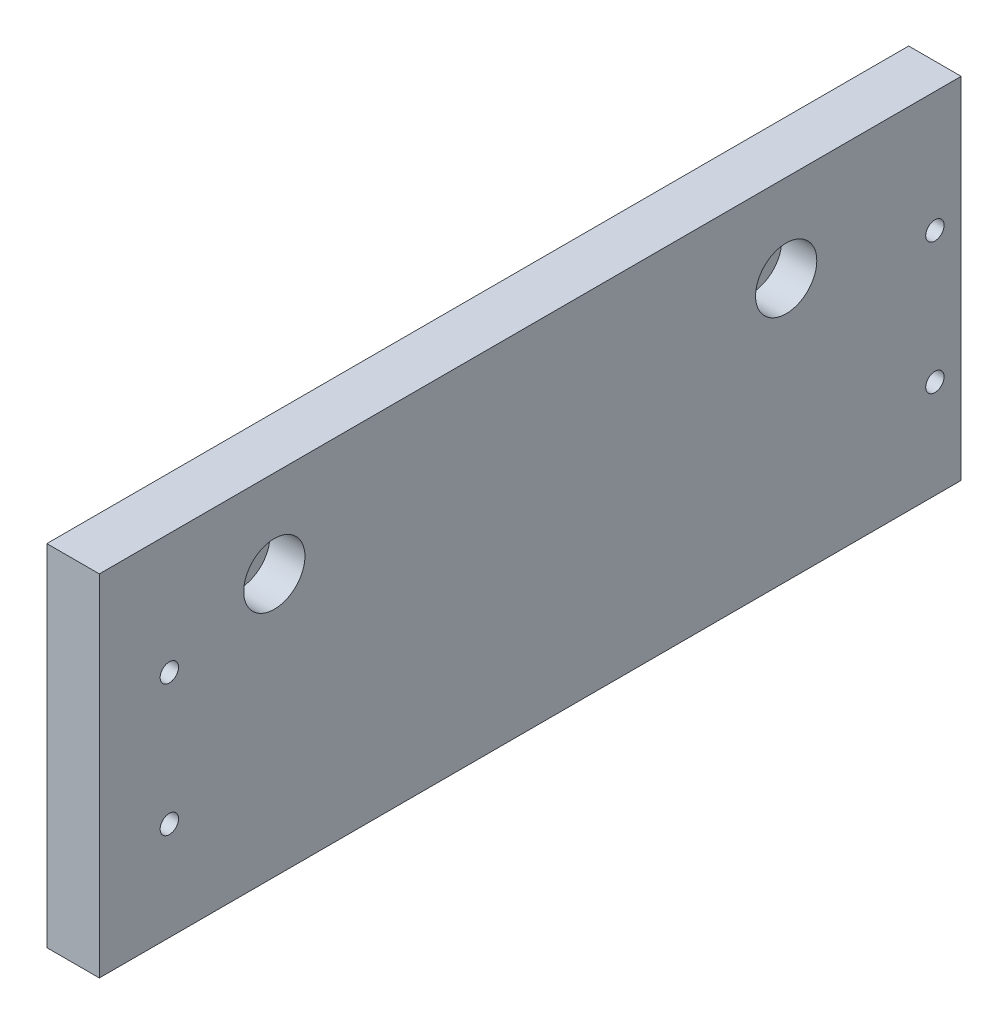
ISO-10303-21;
HEADER;
FILE_DESCRIPTION(('STEP AP214'),'2;1');
FILE_NAME('part.step','',(''),(''),'','','');
FILE_SCHEMA(('AUTOMOTIVE_DESIGN { 1 0 10303 214 1 1 1 1 }'));
ENDSEC;
DATA;
#1=APPLICATION_CONTEXT('core data for automotive mechanical design processes');
#2=APPLICATION_PROTOCOL_DEFINITION('international standard','automotive_design',2000,#1);
#3=PRODUCT_CONTEXT('',#1,'mechanical');
#4=PRODUCT('Part','Part','',(#3));
#5=PRODUCT_RELATED_PRODUCT_CATEGORY('part','',(#4));
#6=PRODUCT_DEFINITION_FORMATION('','',#4);
#7=PRODUCT_DEFINITION_CONTEXT('part definition',#1,'design');
#8=PRODUCT_DEFINITION('design','',#6,#7);
#9=PRODUCT_DEFINITION_SHAPE('','',#8);
#10=(LENGTH_UNIT() NAMED_UNIT(*) SI_UNIT(.MILLI.,.METRE.));
#11=(NAMED_UNIT(*) PLANE_ANGLE_UNIT() SI_UNIT($,.RADIAN.));
#12=(NAMED_UNIT(*) SI_UNIT($,.STERADIAN.) SOLID_ANGLE_UNIT());
#13=UNCERTAINTY_MEASURE_WITH_UNIT(LENGTH_MEASURE(1.E-05),#10,'distance_accuracy_value','');
#14=(GEOMETRIC_REPRESENTATION_CONTEXT(3) GLOBAL_UNCERTAINTY_ASSIGNED_CONTEXT((#13)) GLOBAL_UNIT_ASSIGNED_CONTEXT((#10,
#11,#12)) REPRESENTATION_CONTEXT('',''));
#15=CARTESIAN_POINT('',(0.,0.,0.));
#16=DIRECTION('',(0.,0.,1.));
#17=DIRECTION('',(1.,0.,0.));
#18=AXIS2_PLACEMENT_3D('',#15,#16,#17);
#19=CARTESIAN_POINT('',(4.,20.,-58.5));
#20=DIRECTION('',(1.,0.,0.));
#21=DIRECTION('',(0.,0.,-1.));
#22=AXIS2_PLACEMENT_3D('',#19,#20,#21);
#23=CYLINDRICAL_SURFACE('',#22,7.00000000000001);
#24=CARTESIAN_POINT('',(12.,20.,-58.5));
#25=DIRECTION('',(1.,0.,0.));
#26=DIRECTION('',(0.,0.,-1.));
#27=AXIS2_PLACEMENT_3D('',#24,#25,#26);
#28=CIRCLE('',#27,7.00000000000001);
#29=CARTESIAN_POINT('',(12.,20.,-65.5));
#30=VERTEX_POINT('',#29);
#31=EDGE_CURVE('E121',#30,#30,#28,.F.);
#32=ORIENTED_EDGE('',*,*,#31,.F.);
#33=EDGE_LOOP('',(#32));
#34=FACE_BOUND('',#33,.T.);
#35=CARTESIAN_POINT('',(4.,20.,-58.5));
#36=DIRECTION('',(1.,0.,0.));
#37=DIRECTION('',(0.,0.,-1.));
#38=AXIS2_PLACEMENT_3D('',#35,#36,#37);
#39=CIRCLE('',#38,7.00000000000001);
#40=CARTESIAN_POINT('',(4.,20.,-65.5));
#41=VERTEX_POINT('',#40);
#42=EDGE_CURVE('E20',#41,#41,#39,.T.);
#43=ORIENTED_EDGE('',*,*,#42,.F.);
#44=EDGE_LOOP('',(#43));
#45=FACE_BOUND('',#44,.T.);
#46=ADVANCED_FACE('F17',(#34,#45),#23,.F.);
#47=CARTESIAN_POINT('',(4.,20.,58.5));
#48=DIRECTION('',(1.,0.,0.));
#49=DIRECTION('',(0.,0.,-1.));
#50=AXIS2_PLACEMENT_3D('',#47,#48,#49);
#51=CYLINDRICAL_SURFACE('',#50,7.);
#52=CARTESIAN_POINT('',(12.,20.,58.5));
#53=DIRECTION('',(1.,0.,0.));
#54=DIRECTION('',(0.,0.,-1.));
#55=AXIS2_PLACEMENT_3D('',#52,#53,#54);
#56=CIRCLE('',#55,7.);
#57=CARTESIAN_POINT('',(12.,20.,51.5));
#58=VERTEX_POINT('',#57);
#59=EDGE_CURVE('E118',#58,#58,#56,.F.);
#60=ORIENTED_EDGE('',*,*,#59,.F.);
#61=EDGE_LOOP('',(#60));
#62=FACE_BOUND('',#61,.T.);
#63=CARTESIAN_POINT('',(4.,20.,58.5));
#64=DIRECTION('',(1.,0.,0.));
#65=DIRECTION('',(0.,0.,-1.));
#66=AXIS2_PLACEMENT_3D('',#63,#64,#65);
#67=CIRCLE('',#66,7.);
#68=CARTESIAN_POINT('',(4.,20.,51.5));
#69=VERTEX_POINT('',#68);
#70=EDGE_CURVE('E123',#69,#69,#67,.T.);
#71=ORIENTED_EDGE('',*,*,#70,.F.);
#72=EDGE_LOOP('',(#71));
#73=FACE_BOUND('',#72,.T.);
#74=ADVANCED_FACE('F133',(#62,#73),#51,.F.);
#75=CARTESIAN_POINT('',(4.,20.,-58.5));
#76=DIRECTION('',(1.,0.,0.));
#77=DIRECTION('',(0.,0.,-1.));
#78=AXIS2_PLACEMENT_3D('',#75,#76,#77);
#79=PLANE('',#78);
#80=CARTESIAN_POINT('',(4.,20.,-58.5));
#81=DIRECTION('',(1.,0.,0.));
#82=DIRECTION('',(0.,0.,-1.));
#83=AXIS2_PLACEMENT_3D('',#80,#81,#82);
#84=CIRCLE('',#83,4.25);
#85=CARTESIAN_POINT('',(4.,20.,-62.75));
#86=VERTEX_POINT('',#85);
#87=EDGE_CURVE('E115',#86,#86,#84,.F.);
#88=ORIENTED_EDGE('',*,*,#87,.T.);
#89=EDGE_LOOP('',(#88));
#90=FACE_BOUND('',#89,.T.);
#91=ORIENTED_EDGE('',*,*,#42,.T.);
#92=EDGE_LOOP('',(#91));
#93=FACE_BOUND('',#92,.T.);
#94=ADVANCED_FACE('F130',(#90,#93),#79,.T.);
#95=CARTESIAN_POINT('',(4.,20.,58.5));
#96=DIRECTION('',(1.,0.,0.));
#97=DIRECTION('',(0.,0.,-1.));
#98=AXIS2_PLACEMENT_3D('',#95,#96,#97);
#99=PLANE('',#98);
#100=CARTESIAN_POINT('',(4.,20.,58.5));
#101=DIRECTION('',(1.,0.,0.));
#102=DIRECTION('',(0.,0.,-1.));
#103=AXIS2_PLACEMENT_3D('',#100,#101,#102);
#104=CIRCLE('',#103,4.25);
#105=CARTESIAN_POINT('',(4.,20.,54.25));
#106=VERTEX_POINT('',#105);
#107=EDGE_CURVE('E112',#106,#106,#104,.F.);
#108=ORIENTED_EDGE('',*,*,#107,.T.);
#109=EDGE_LOOP('',(#108));
#110=FACE_BOUND('',#109,.T.);
#111=ORIENTED_EDGE('',*,*,#70,.T.);
#112=EDGE_LOOP('',(#111));
#113=FACE_BOUND('',#112,.T.);
#114=ADVANCED_FACE('F187',(#110,#113),#99,.T.);
#115=CARTESIAN_POINT('',(12.,0.,0.));
#116=DIRECTION('',(1.,0.,0.));
#117=DIRECTION('',(0.,0.,-1.));
#118=AXIS2_PLACEMENT_3D('',#115,#116,#117);
#119=PLANE('',#118);
#120=DIRECTION('',(0.,1.,0.));
#121=VECTOR('',#120,1.);
#122=CARTESIAN_POINT('',(12.,40.,98.5));
#123=LINE('',#122,#121);
#124=CARTESIAN_POINT('',(12.,40.,98.5));
#125=VERTEX_POINT('',#124);
#126=CARTESIAN_POINT('',(12.,-40.,98.5));
#127=VERTEX_POINT('',#126);
#128=EDGE_CURVE('E55',#125,#127,#123,.F.);
#129=ORIENTED_EDGE('',*,*,#128,.T.);
#130=DIRECTION('',(0.,0.,1.));
#131=VECTOR('',#130,1.);
#132=CARTESIAN_POINT('',(12.,-40.,98.5));
#133=LINE('',#132,#131);
#134=CARTESIAN_POINT('',(12.,-40.,-98.5));
#135=VERTEX_POINT('',#134);
#136=EDGE_CURVE('E358',#127,#135,#133,.F.);
#137=ORIENTED_EDGE('',*,*,#136,.T.);
#138=DIRECTION('',(0.,-1.,0.));
#139=VECTOR('',#138,1.);
#140=CARTESIAN_POINT('',(12.,40.,-98.5));
#141=LINE('',#140,#139);
#142=CARTESIAN_POINT('',(12.,40.,-98.5));
#143=VERTEX_POINT('',#142);
#144=EDGE_CURVE('E61',#135,#143,#141,.F.);
#145=ORIENTED_EDGE('',*,*,#144,.T.);
#146=DIRECTION('',(0.,0.,-1.));
#147=VECTOR('',#146,1.);
#148=CARTESIAN_POINT('',(12.,40.,98.5));
#149=LINE('',#148,#147);
#150=EDGE_CURVE('E58',#143,#125,#149,.F.);
#151=ORIENTED_EDGE('',*,*,#150,.T.);
#152=EDGE_LOOP('',(#129,#137,#145,#151));
#153=FACE_BOUND('',#152,.T.);
#154=CARTESIAN_POINT('',(12.,-17.5,-92.5));
#155=DIRECTION('',(1.,0.,0.));
#156=DIRECTION('',(0.,0.,-1.));
#157=AXIS2_PLACEMENT_3D('',#154,#155,#156);
#158=CIRCLE('',#157,2.09999999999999);
#159=CARTESIAN_POINT('',(12.,-17.5,-94.6));
#160=VERTEX_POINT('',#159);
#161=EDGE_CURVE('E67',#160,#160,#158,.F.);
#162=ORIENTED_EDGE('',*,*,#161,.T.);
#163=EDGE_LOOP('',(#162));
#164=FACE_BOUND('',#163,.T.);
#165=CARTESIAN_POINT('',(12.,12.5,-92.5));
#166=DIRECTION('',(1.,0.,0.));
#167=DIRECTION('',(0.,0.,-1.));
#168=AXIS2_PLACEMENT_3D('',#165,#166,#167);
#169=CIRCLE('',#168,2.09999999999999);
#170=CARTESIAN_POINT('',(12.,12.5,-94.6));
#171=VERTEX_POINT('',#170);
#172=EDGE_CURVE('E103',#171,#171,#169,.F.);
#173=ORIENTED_EDGE('',*,*,#172,.T.);
#174=EDGE_LOOP('',(#173));
#175=FACE_BOUND('',#174,.T.);
#176=CARTESIAN_POINT('',(12.,-17.5,82.5));
#177=DIRECTION('',(1.,0.,0.));
#178=DIRECTION('',(0.,0.,-1.));
#179=AXIS2_PLACEMENT_3D('',#176,#177,#178);
#180=CIRCLE('',#179,2.09999999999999);
#181=CARTESIAN_POINT('',(12.,-17.5,80.4));
#182=VERTEX_POINT('',#181);
#183=EDGE_CURVE('E106',#182,#182,#180,.F.);
#184=ORIENTED_EDGE('',*,*,#183,.T.);
#185=EDGE_LOOP('',(#184));
#186=FACE_BOUND('',#185,.T.);
#187=CARTESIAN_POINT('',(12.,12.5,82.5));
#188=DIRECTION('',(1.,0.,0.));
#189=DIRECTION('',(0.,0.,-1.));
#190=AXIS2_PLACEMENT_3D('',#187,#188,#189);
#191=CIRCLE('',#190,2.09999999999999);
#192=CARTESIAN_POINT('',(12.,12.5,80.4));
#193=VERTEX_POINT('',#192);
#194=EDGE_CURVE('E109',#193,#193,#191,.F.);
#195=ORIENTED_EDGE('',*,*,#194,.T.);
#196=EDGE_LOOP('',(#195));
#197=FACE_BOUND('',#196,.T.);
#198=ORIENTED_EDGE('',*,*,#59,.T.);
#199=EDGE_LOOP('',(#198));
#200=FACE_BOUND('',#199,.T.);
#201=ORIENTED_EDGE('',*,*,#31,.T.);
#202=EDGE_LOOP('',(#201));
#203=FACE_BOUND('',#202,.T.);
#204=ADVANCED_FACE('F59',(#153,#164,#175,#186,#197,#200,#203),#119,.T.);
#205=CARTESIAN_POINT('',(0.,20.,-58.5));
#206=DIRECTION('',(1.,0.,0.));
#207=DIRECTION('',(0.,0.,-1.));
#208=AXIS2_PLACEMENT_3D('',#205,#206,#207);
#209=CYLINDRICAL_SURFACE('',#208,4.25);
#210=CARTESIAN_POINT('',(0.,20.,-58.5));
#211=DIRECTION('',(1.,0.,0.));
#212=DIRECTION('',(0.,0.,-1.));
#213=AXIS2_PLACEMENT_3D('',#210,#211,#212);
#214=CIRCLE('',#213,4.25);
#215=CARTESIAN_POINT('',(0.,20.,-62.75));
#216=VERTEX_POINT('',#215);
#217=EDGE_CURVE('E97',#216,#216,#214,.F.);
#218=ORIENTED_EDGE('',*,*,#217,.T.);
#219=EDGE_LOOP('',(#218));
#220=FACE_BOUND('',#219,.T.);
#221=ORIENTED_EDGE('',*,*,#87,.F.);
#222=EDGE_LOOP('',(#221));
#223=FACE_BOUND('',#222,.T.);
#224=ADVANCED_FACE('F180',(#220,#223),#209,.F.);
#225=CARTESIAN_POINT('',(0.,20.,58.5));
#226=DIRECTION('',(1.,0.,0.));
#227=DIRECTION('',(0.,0.,-1.));
#228=AXIS2_PLACEMENT_3D('',#225,#226,#227);
#229=CYLINDRICAL_SURFACE('',#228,4.25);
#230=CARTESIAN_POINT('',(0.,20.,58.5));
#231=DIRECTION('',(1.,0.,0.));
#232=DIRECTION('',(0.,0.,-1.));
#233=AXIS2_PLACEMENT_3D('',#230,#231,#232);
#234=CIRCLE('',#233,4.25);
#235=CARTESIAN_POINT('',(0.,20.,54.25));
#236=VERTEX_POINT('',#235);
#237=EDGE_CURVE('E94',#236,#236,#234,.F.);
#238=ORIENTED_EDGE('',*,*,#237,.T.);
#239=EDGE_LOOP('',(#238));
#240=FACE_BOUND('',#239,.T.);
#241=ORIENTED_EDGE('',*,*,#107,.F.);
#242=EDGE_LOOP('',(#241));
#243=FACE_BOUND('',#242,.T.);
#244=ADVANCED_FACE('F176',(#240,#243),#229,.F.);
#245=CARTESIAN_POINT('',(12.,12.5,82.5));
#246=DIRECTION('',(1.,0.,0.));
#247=DIRECTION('',(0.,0.,-1.));
#248=AXIS2_PLACEMENT_3D('',#245,#246,#247);
#249=CYLINDRICAL_SURFACE('',#248,2.09999999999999);
#250=CARTESIAN_POINT('',(0.,12.5,82.5));
#251=DIRECTION('',(1.,0.,0.));
#252=DIRECTION('',(0.,0.,-1.));
#253=AXIS2_PLACEMENT_3D('',#250,#251,#252);
#254=CIRCLE('',#253,2.09999999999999);
#255=CARTESIAN_POINT('',(0.,12.5,80.4));
#256=VERTEX_POINT('',#255);
#257=EDGE_CURVE('E91',#256,#256,#254,.F.);
#258=ORIENTED_EDGE('',*,*,#257,.T.);
#259=EDGE_LOOP('',(#258));
#260=FACE_BOUND('',#259,.T.);
#261=ORIENTED_EDGE('',*,*,#194,.F.);
#262=EDGE_LOOP('',(#261));
#263=FACE_BOUND('',#262,.T.);
#264=ADVANCED_FACE('F172',(#260,#263),#249,.F.);
#265=CARTESIAN_POINT('',(12.,-17.5,82.5));
#266=DIRECTION('',(1.,0.,0.));
#267=DIRECTION('',(0.,0.,-1.));
#268=AXIS2_PLACEMENT_3D('',#265,#266,#267);
#269=CYLINDRICAL_SURFACE('',#268,2.09999999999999);
#270=CARTESIAN_POINT('',(0.,-17.5,82.5));
#271=DIRECTION('',(1.,0.,0.));
#272=DIRECTION('',(0.,0.,-1.));
#273=AXIS2_PLACEMENT_3D('',#270,#271,#272);
#274=CIRCLE('',#273,2.09999999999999);
#275=CARTESIAN_POINT('',(0.,-17.5,80.4));
#276=VERTEX_POINT('',#275);
#277=EDGE_CURVE('E88',#276,#276,#274,.F.);
#278=ORIENTED_EDGE('',*,*,#277,.T.);
#279=EDGE_LOOP('',(#278));
#280=FACE_BOUND('',#279,.T.);
#281=ORIENTED_EDGE('',*,*,#183,.F.);
#282=EDGE_LOOP('',(#281));
#283=FACE_BOUND('',#282,.T.);
#284=ADVANCED_FACE('F168',(#280,#283),#269,.F.);
#285=CARTESIAN_POINT('',(12.,12.5,-92.5));
#286=DIRECTION('',(1.,0.,0.));
#287=DIRECTION('',(0.,0.,-1.));
#288=AXIS2_PLACEMENT_3D('',#285,#286,#287);
#289=CYLINDRICAL_SURFACE('',#288,2.09999999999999);
#290=CARTESIAN_POINT('',(0.,12.5,-92.5));
#291=DIRECTION('',(1.,0.,0.));
#292=DIRECTION('',(0.,0.,-1.));
#293=AXIS2_PLACEMENT_3D('',#290,#291,#292);
#294=CIRCLE('',#293,2.09999999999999);
#295=CARTESIAN_POINT('',(0.,12.5,-94.6));
#296=VERTEX_POINT('',#295);
#297=EDGE_CURVE('E85',#296,#296,#294,.F.);
#298=ORIENTED_EDGE('',*,*,#297,.T.);
#299=EDGE_LOOP('',(#298));
#300=FACE_BOUND('',#299,.T.);
#301=ORIENTED_EDGE('',*,*,#172,.F.);
#302=EDGE_LOOP('',(#301));
#303=FACE_BOUND('',#302,.T.);
#304=ADVANCED_FACE('F164',(#300,#303),#289,.F.);
#305=CARTESIAN_POINT('',(12.,-17.5,-92.5));
#306=DIRECTION('',(1.,0.,0.));
#307=DIRECTION('',(0.,0.,-1.));
#308=AXIS2_PLACEMENT_3D('',#305,#306,#307);
#309=CYLINDRICAL_SURFACE('',#308,2.09999999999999);
#310=CARTESIAN_POINT('',(0.,-17.5,-92.5));
#311=DIRECTION('',(1.,0.,0.));
#312=DIRECTION('',(0.,0.,-1.));
#313=AXIS2_PLACEMENT_3D('',#310,#311,#312);
#314=CIRCLE('',#313,2.09999999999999);
#315=CARTESIAN_POINT('',(0.,-17.5,-94.6));
#316=VERTEX_POINT('',#315);
#317=EDGE_CURVE('E82',#316,#316,#314,.F.);
#318=ORIENTED_EDGE('',*,*,#317,.T.);
#319=EDGE_LOOP('',(#318));
#320=FACE_BOUND('',#319,.T.);
#321=ORIENTED_EDGE('',*,*,#161,.F.);
#322=EDGE_LOOP('',(#321));
#323=FACE_BOUND('',#322,.T.);
#324=ADVANCED_FACE('F161',(#320,#323),#309,.F.);
#325=CARTESIAN_POINT('',(12.,40.,98.5));
#326=DIRECTION('',(0.,-1.,0.));
#327=DIRECTION('',(0.,0.,-1.));
#328=AXIS2_PLACEMENT_3D('',#325,#326,#327);
#329=PLANE('',#328);
#330=DIRECTION('',(-1.,0.,0.));
#331=VECTOR('',#330,1.);
#332=CARTESIAN_POINT('',(12.,40.,98.5));
#333=LINE('',#332,#331);
#334=CARTESIAN_POINT('',(0.,40.,98.5));
#335=VERTEX_POINT('',#334);
#336=EDGE_CURVE('E66',#335,#125,#333,.F.);
#337=ORIENTED_EDGE('',*,*,#336,.T.);
#338=ORIENTED_EDGE('',*,*,#150,.F.);
#339=DIRECTION('',(1.,0.,0.));
#340=VECTOR('',#339,1.);
#341=CARTESIAN_POINT('',(12.,40.,-98.5));
#342=LINE('',#341,#340);
#343=CARTESIAN_POINT('',(0.,40.,-98.5));
#344=VERTEX_POINT('',#343);
#345=EDGE_CURVE('E100',#143,#344,#342,.F.);
#346=ORIENTED_EDGE('',*,*,#345,.T.);
#347=DIRECTION('',(0.,0.,-1.));
#348=VECTOR('',#347,1.);
#349=CARTESIAN_POINT('',(0.,40.,0.));
#350=LINE('',#349,#348);
#351=EDGE_CURVE('E78',#344,#335,#350,.F.);
#352=ORIENTED_EDGE('',*,*,#351,.T.);
#353=EDGE_LOOP('',(#337,#338,#346,#352));
#354=FACE_BOUND('',#353,.T.);
#355=ADVANCED_FACE('F77',(#354),#329,.F.);
#356=CARTESIAN_POINT('',(12.,40.,98.5));
#357=DIRECTION('',(0.,0.,-1.));
#358=DIRECTION('',(-1.,0.,0.));
#359=AXIS2_PLACEMENT_3D('',#356,#357,#358);
#360=PLANE('',#359);
#361=DIRECTION('',(1.,0.,0.));
#362=VECTOR('',#361,1.);
#363=CARTESIAN_POINT('',(12.,-40.,98.5));
#364=LINE('',#363,#362);
#365=CARTESIAN_POINT('',(0.,-40.,98.5));
#366=VERTEX_POINT('',#365);
#367=EDGE_CURVE('E74',#366,#127,#364,.T.);
#368=ORIENTED_EDGE('',*,*,#367,.T.);
#369=ORIENTED_EDGE('',*,*,#128,.F.);
#370=ORIENTED_EDGE('',*,*,#336,.F.);
#371=DIRECTION('',(0.,1.,0.));
#372=VECTOR('',#371,1.);
#373=CARTESIAN_POINT('',(0.,0.,98.5));
#374=LINE('',#373,#372);
#375=EDGE_CURVE('E365',#335,#366,#374,.F.);
#376=ORIENTED_EDGE('',*,*,#375,.T.);
#377=EDGE_LOOP('',(#368,#369,#370,#376));
#378=FACE_BOUND('',#377,.T.);
#379=ADVANCED_FACE('F71',(#378),#360,.F.);
#380=CARTESIAN_POINT('',(12.,-40.,98.5));
#381=DIRECTION('',(0.,1.,0.));
#382=DIRECTION('',(0.,0.,1.));
#383=AXIS2_PLACEMENT_3D('',#380,#381,#382);
#384=PLANE('',#383);
#385=DIRECTION('',(1.,0.,0.));
#386=VECTOR('',#385,1.);
#387=CARTESIAN_POINT('',(12.,-40.,-98.5));
#388=LINE('',#387,#386);
#389=CARTESIAN_POINT('',(0.,-40.,-98.5));
#390=VERTEX_POINT('',#389);
#391=EDGE_CURVE('E34',#390,#135,#388,.T.);
#392=ORIENTED_EDGE('',*,*,#391,.T.);
#393=ORIENTED_EDGE('',*,*,#136,.F.);
#394=ORIENTED_EDGE('',*,*,#367,.F.);
#395=DIRECTION('',(0.,0.,-1.));
#396=VECTOR('',#395,1.);
#397=CARTESIAN_POINT('',(0.,-40.,0.));
#398=LINE('',#397,#396);
#399=EDGE_CURVE('E26',#366,#390,#398,.T.);
#400=ORIENTED_EDGE('',*,*,#399,.T.);
#401=EDGE_LOOP('',(#392,#393,#394,#400));
#402=FACE_BOUND('',#401,.T.);
#403=ADVANCED_FACE('F149',(#402),#384,.F.);
#404=CARTESIAN_POINT('',(12.,40.,-98.5));
#405=DIRECTION('',(0.,0.,1.));
#406=DIRECTION('',(0.,-1.,0.));
#407=AXIS2_PLACEMENT_3D('',#404,#405,#406);
#408=PLANE('',#407);
#409=ORIENTED_EDGE('',*,*,#345,.F.);
#410=ORIENTED_EDGE('',*,*,#144,.F.);
#411=ORIENTED_EDGE('',*,*,#391,.F.);
#412=DIRECTION('',(0.,1.,0.));
#413=VECTOR('',#412,1.);
#414=CARTESIAN_POINT('',(0.,0.,-98.5));
#415=LINE('',#414,#413);
#416=EDGE_CURVE('E11',#390,#344,#415,.T.);
#417=ORIENTED_EDGE('',*,*,#416,.T.);
#418=EDGE_LOOP('',(#409,#410,#411,#417));
#419=FACE_BOUND('',#418,.T.);
#420=ADVANCED_FACE('F143',(#419),#408,.F.);
#421=CARTESIAN_POINT('',(0.,0.,0.));
#422=DIRECTION('',(1.,0.,0.));
#423=DIRECTION('',(0.,0.,-1.));
#424=AXIS2_PLACEMENT_3D('',#421,#422,#423);
#425=PLANE('',#424);
#426=ORIENTED_EDGE('',*,*,#399,.F.);
#427=ORIENTED_EDGE('',*,*,#375,.F.);
#428=ORIENTED_EDGE('',*,*,#351,.F.);
#429=ORIENTED_EDGE('',*,*,#416,.F.);
#430=EDGE_LOOP('',(#426,#427,#428,#429));
#431=FACE_BOUND('',#430,.T.);
#432=ORIENTED_EDGE('',*,*,#317,.F.);
#433=EDGE_LOOP('',(#432));
#434=FACE_BOUND('',#433,.T.);
#435=ORIENTED_EDGE('',*,*,#297,.F.);
#436=EDGE_LOOP('',(#435));
#437=FACE_BOUND('',#436,.T.);
#438=ORIENTED_EDGE('',*,*,#277,.F.);
#439=EDGE_LOOP('',(#438));
#440=FACE_BOUND('',#439,.T.);
#441=ORIENTED_EDGE('',*,*,#257,.F.);
#442=EDGE_LOOP('',(#441));
#443=FACE_BOUND('',#442,.T.);
#444=ORIENTED_EDGE('',*,*,#237,.F.);
#445=EDGE_LOOP('',(#444));
#446=FACE_BOUND('',#445,.T.);
#447=ORIENTED_EDGE('',*,*,#217,.F.);
#448=EDGE_LOOP('',(#447));
#449=FACE_BOUND('',#448,.T.);
#450=ADVANCED_FACE('F141',(#431,#434,#437,#440,#443,#446,#449),#425,.F.);
#451=CLOSED_SHELL('',(#46,#74,#94,#114,#204,#224,#244,#264,#284,#304,#324,#355,#379,#403,#420,#450));
#452=MANIFOLD_SOLID_BREP('B1',#451);
#453=ADVANCED_BREP_SHAPE_REPRESENTATION('',(#18,#452),#14);
#454=SHAPE_DEFINITION_REPRESENTATION(#9,#453);
ENDSEC;
END-ISO-10303-21;
